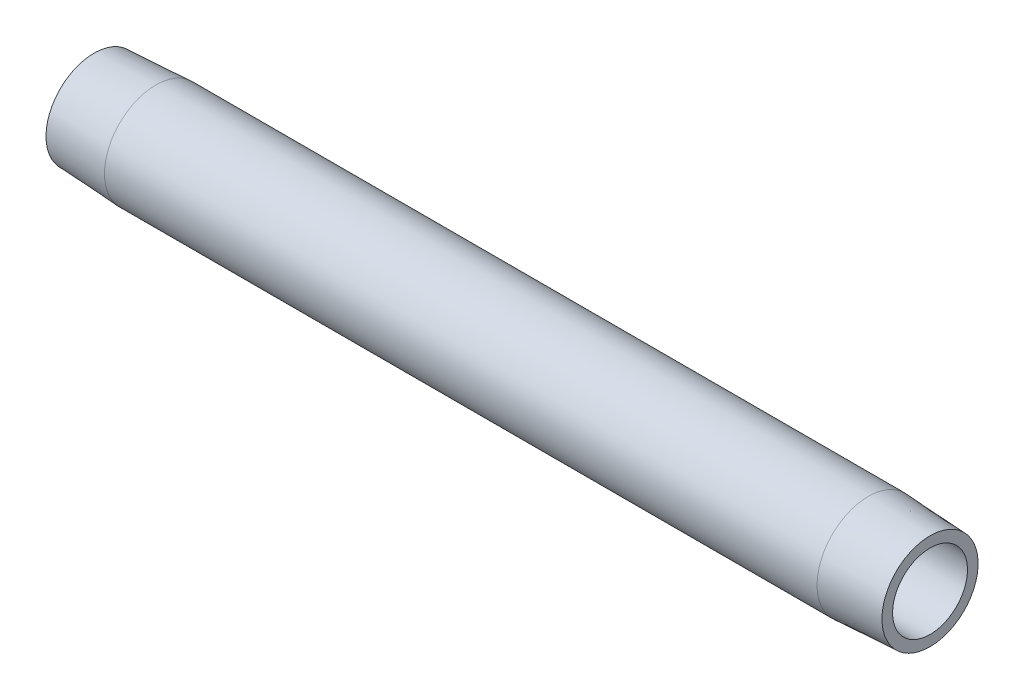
ISO-10303-21;
HEADER;
FILE_DESCRIPTION(('STEP AP214'),'2;1');
FILE_NAME('part.step','',(''),(''),'','','');
FILE_SCHEMA(('AUTOMOTIVE_DESIGN { 1 0 10303 214 1 1 1 1 }'));
ENDSEC;
DATA;
#1=APPLICATION_CONTEXT('core data for automotive mechanical design processes');
#2=APPLICATION_PROTOCOL_DEFINITION('international standard','automotive_design',2000,#1);
#3=PRODUCT_CONTEXT('',#1,'mechanical');
#4=PRODUCT('Part','Part','',(#3));
#5=PRODUCT_RELATED_PRODUCT_CATEGORY('part','',(#4));
#6=PRODUCT_DEFINITION_FORMATION('','',#4);
#7=PRODUCT_DEFINITION_CONTEXT('part definition',#1,'design');
#8=PRODUCT_DEFINITION('design','',#6,#7);
#9=PRODUCT_DEFINITION_SHAPE('','',#8);
#10=(LENGTH_UNIT() NAMED_UNIT(*) SI_UNIT(.MILLI.,.METRE.));
#11=(NAMED_UNIT(*) PLANE_ANGLE_UNIT() SI_UNIT($,.RADIAN.));
#12=(NAMED_UNIT(*) SI_UNIT($,.STERADIAN.) SOLID_ANGLE_UNIT());
#13=UNCERTAINTY_MEASURE_WITH_UNIT(LENGTH_MEASURE(1.E-05),#10,'distance_accuracy_value','');
#14=(GEOMETRIC_REPRESENTATION_CONTEXT(3) GLOBAL_UNCERTAINTY_ASSIGNED_CONTEXT((#13)) GLOBAL_UNIT_ASSIGNED_CONTEXT((#10,
#11,#12)) REPRESENTATION_CONTEXT('',''));
#15=CARTESIAN_POINT('',(0.,0.,0.));
#16=DIRECTION('',(0.,0.,1.));
#17=DIRECTION('',(1.,0.,0.));
#18=AXIS2_PLACEMENT_3D('',#15,#16,#17);
#19=CARTESIAN_POINT('',(139.7,6.26110000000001,0.));
#20=DIRECTION('',(-1.,0.,0.));
#21=DIRECTION('',(0.,0.,1.));
#22=AXIS2_PLACEMENT_3D('',#19,#20,#21);
#23=PLANE('',#22);
#24=CARTESIAN_POINT('',(139.7,0.,0.));
#25=DIRECTION('',(-1.,0.,0.));
#26=DIRECTION('',(0.,0.,1.));
#27=AXIS2_PLACEMENT_3D('',#24,#25,#26);
#28=CIRCLE('',#27,8.03205001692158);
#29=CARTESIAN_POINT('',(139.7,0.,8.03205001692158));
#30=VERTEX_POINT('',#29);
#31=EDGE_CURVE('E10',#30,#30,#28,.T.);
#32=ORIENTED_EDGE('',*,*,#31,.F.);
#33=EDGE_LOOP('',(#32));
#34=FACE_BOUND('',#33,.T.);
#35=CARTESIAN_POINT('',(139.7,0.,0.));
#36=DIRECTION('',(-1.,0.,0.));
#37=DIRECTION('',(0.,0.,1.));
#38=AXIS2_PLACEMENT_3D('',#35,#36,#37);
#39=CIRCLE('',#38,6.26110000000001);
#40=CARTESIAN_POINT('',(139.7,0.,6.26110000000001));
#41=VERTEX_POINT('',#40);
#42=EDGE_CURVE('E52',#41,#41,#39,.T.);
#43=ORIENTED_EDGE('',*,*,#42,.T.);
#44=EDGE_LOOP('',(#43));
#45=FACE_BOUND('',#44,.T.);
#46=ADVANCED_FACE('F30',(#34,#45),#23,.F.);
#47=CARTESIAN_POINT('',(139.7,0.,0.));
#48=DIRECTION('',(-1.,0.,0.));
#49=DIRECTION('',(0.,0.,1.));
#50=AXIS2_PLACEMENT_3D('',#47,#48,#49);
#51=CONICAL_SURFACE('',#50,8.03205001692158,0.0523598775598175);
#52=CARTESIAN_POINT('',(129.3876,0.,0.));
#53=DIRECTION('',(-1.,0.,0.));
#54=DIRECTION('',(0.,0.,1.));
#55=AXIS2_PLACEMENT_3D('',#52,#53,#54);
#56=CIRCLE('',#55,8.57249999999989);
#57=CARTESIAN_POINT('',(129.3876,0.,8.57249999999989));
#58=VERTEX_POINT('',#57);
#59=EDGE_CURVE('E36',#58,#58,#56,.T.);
#60=ORIENTED_EDGE('',*,*,#59,.F.);
#61=EDGE_LOOP('',(#60));
#62=FACE_BOUND('',#61,.T.);
#63=ORIENTED_EDGE('',*,*,#31,.T.);
#64=EDGE_LOOP('',(#63));
#65=FACE_BOUND('',#64,.T.);
#66=ADVANCED_FACE('F77',(#62,#65),#51,.T.);
#67=CARTESIAN_POINT('',(0.,0.,0.));
#68=DIRECTION('',(-1.,0.,0.));
#69=DIRECTION('',(0.,0.,1.));
#70=AXIS2_PLACEMENT_3D('',#67,#68,#69);
#71=CYLINDRICAL_SURFACE('',#70,8.57249999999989);
#72=CARTESIAN_POINT('',(10.3124,0.,0.));
#73=DIRECTION('',(-1.,0.,0.));
#74=DIRECTION('',(0.,0.,1.));
#75=AXIS2_PLACEMENT_3D('',#72,#73,#74);
#76=CIRCLE('',#75,8.57249999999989);
#77=CARTESIAN_POINT('',(10.3124,0.,8.57249999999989));
#78=VERTEX_POINT('',#77);
#79=EDGE_CURVE('E40',#78,#78,#76,.T.);
#80=ORIENTED_EDGE('',*,*,#79,.F.);
#81=EDGE_LOOP('',(#80));
#82=FACE_BOUND('',#81,.T.);
#83=ORIENTED_EDGE('',*,*,#59,.T.);
#84=EDGE_LOOP('',(#83));
#85=FACE_BOUND('',#84,.T.);
#86=ADVANCED_FACE('F72',(#82,#85),#71,.T.);
#87=CARTESIAN_POINT('',(10.3124,0.,0.));
#88=DIRECTION('',(1.,0.,0.));
#89=DIRECTION('',(0.,0.,-1.));
#90=AXIS2_PLACEMENT_3D('',#87,#88,#89);
#91=CONICAL_SURFACE('',#90,8.57249999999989,0.0523598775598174);
#92=CARTESIAN_POINT('',(0.,0.,0.));
#93=DIRECTION('',(-1.,0.,0.));
#94=DIRECTION('',(0.,0.,1.));
#95=AXIS2_PLACEMENT_3D('',#92,#93,#94);
#96=CIRCLE('',#95,8.03205001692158);
#97=CARTESIAN_POINT('',(0.,0.,8.03205001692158));
#98=VERTEX_POINT('',#97);
#99=EDGE_CURVE('E44',#98,#98,#96,.T.);
#100=ORIENTED_EDGE('',*,*,#99,.F.);
#101=EDGE_LOOP('',(#100));
#102=FACE_BOUND('',#101,.T.);
#103=ORIENTED_EDGE('',*,*,#79,.T.);
#104=EDGE_LOOP('',(#103));
#105=FACE_BOUND('',#104,.T.);
#106=ADVANCED_FACE('F66',(#102,#105),#91,.T.);
#107=CARTESIAN_POINT('',(0.,6.26110000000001,0.));
#108=DIRECTION('',(1.,0.,0.));
#109=DIRECTION('',(0.,0.,-1.));
#110=AXIS2_PLACEMENT_3D('',#107,#108,#109);
#111=PLANE('',#110);
#112=CARTESIAN_POINT('',(0.,0.,0.));
#113=DIRECTION('',(-1.,0.,0.));
#114=DIRECTION('',(0.,0.,1.));
#115=AXIS2_PLACEMENT_3D('',#112,#113,#114);
#116=CIRCLE('',#115,6.26110000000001);
#117=CARTESIAN_POINT('',(0.,0.,6.26110000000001));
#118=VERTEX_POINT('',#117);
#119=EDGE_CURVE('E49',#118,#118,#116,.T.);
#120=ORIENTED_EDGE('',*,*,#119,.F.);
#121=EDGE_LOOP('',(#120));
#122=FACE_BOUND('',#121,.T.);
#123=ORIENTED_EDGE('',*,*,#99,.T.);
#124=EDGE_LOOP('',(#123));
#125=FACE_BOUND('',#124,.T.);
#126=ADVANCED_FACE('F60',(#122,#125),#111,.F.);
#127=CARTESIAN_POINT('',(0.,0.,0.));
#128=DIRECTION('',(-1.,0.,0.));
#129=DIRECTION('',(0.,0.,1.));
#130=AXIS2_PLACEMENT_3D('',#127,#128,#129);
#131=CYLINDRICAL_SURFACE('',#130,6.26110000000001);
#132=ORIENTED_EDGE('',*,*,#42,.F.);
#133=EDGE_LOOP('',(#132));
#134=FACE_BOUND('',#133,.T.);
#135=ORIENTED_EDGE('',*,*,#119,.T.);
#136=EDGE_LOOP('',(#135));
#137=FACE_BOUND('',#136,.T.);
#138=ADVANCED_FACE('F57',(#134,#137),#131,.F.);
#139=CLOSED_SHELL('',(#46,#66,#86,#106,#126,#138));
#140=MANIFOLD_SOLID_BREP('B2',#139);
#141=ADVANCED_BREP_SHAPE_REPRESENTATION('',(#18,#140),#14);
#142=SHAPE_DEFINITION_REPRESENTATION(#9,#141);
ENDSEC;
END-ISO-10303-21;
